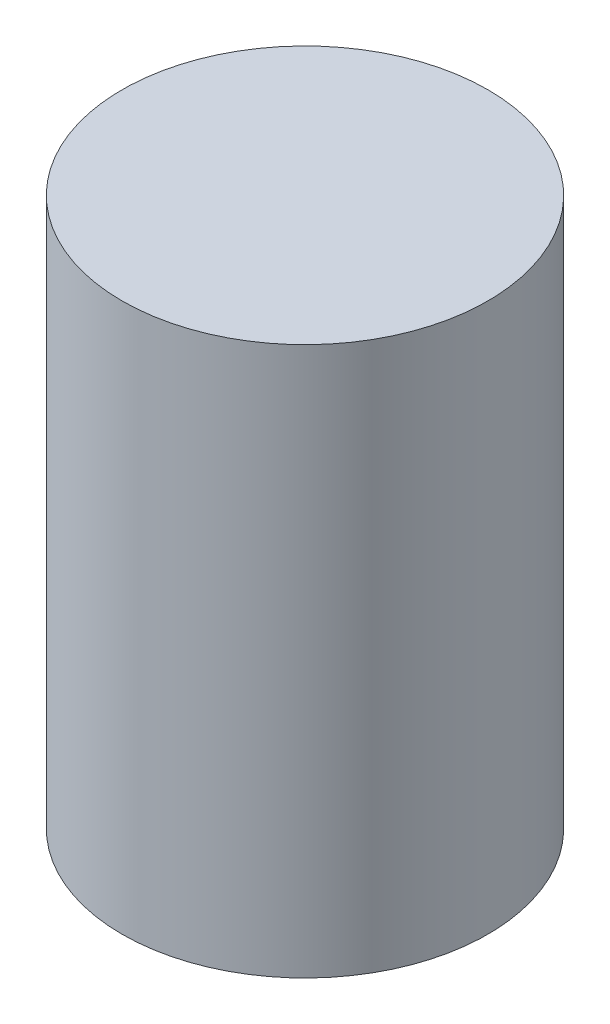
ISO-10303-21;
HEADER;
FILE_DESCRIPTION(('STEP AP214'),'2;1');
FILE_NAME('part.step','',(''),(''),'','','');
FILE_SCHEMA(('AUTOMOTIVE_DESIGN { 1 0 10303 214 1 1 1 1 }'));
ENDSEC;
DATA;
#1=APPLICATION_CONTEXT('core data for automotive mechanical design processes');
#2=APPLICATION_PROTOCOL_DEFINITION('international standard','automotive_design',2000,#1);
#3=PRODUCT_CONTEXT('',#1,'mechanical');
#4=PRODUCT('Part','Part','',(#3));
#5=PRODUCT_RELATED_PRODUCT_CATEGORY('part','',(#4));
#6=PRODUCT_DEFINITION_FORMATION('','',#4);
#7=PRODUCT_DEFINITION_CONTEXT('part definition',#1,'design');
#8=PRODUCT_DEFINITION('design','',#6,#7);
#9=PRODUCT_DEFINITION_SHAPE('','',#8);
#10=(LENGTH_UNIT() NAMED_UNIT(*) SI_UNIT(.MILLI.,.METRE.));
#11=(NAMED_UNIT(*) PLANE_ANGLE_UNIT() SI_UNIT($,.RADIAN.));
#12=(NAMED_UNIT(*) SI_UNIT($,.STERADIAN.) SOLID_ANGLE_UNIT());
#13=UNCERTAINTY_MEASURE_WITH_UNIT(LENGTH_MEASURE(1.E-05),#10,'distance_accuracy_value','');
#14=(GEOMETRIC_REPRESENTATION_CONTEXT(3) GLOBAL_UNCERTAINTY_ASSIGNED_CONTEXT((#13)) GLOBAL_UNIT_ASSIGNED_CONTEXT((#10,
#11,#12)) REPRESENTATION_CONTEXT('',''));
#15=CARTESIAN_POINT('',(0.,0.,0.));
#16=DIRECTION('',(0.,0.,1.));
#17=DIRECTION('',(1.,0.,0.));
#18=AXIS2_PLACEMENT_3D('',#15,#16,#17);
#19=CARTESIAN_POINT('',(0.,152.4,0.));
#20=DIRECTION('',(0.,-1.,0.));
#21=DIRECTION('',(0.,0.,-1.));
#22=AXIS2_PLACEMENT_3D('',#19,#20,#21);
#23=CYLINDRICAL_SURFACE('',#22,50.8240390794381);
#24=CARTESIAN_POINT('',(0.,152.4,0.));
#25=DIRECTION('',(0.,1.,0.));
#26=DIRECTION('',(0.,0.,1.));
#27=AXIS2_PLACEMENT_3D('',#24,#25,#26);
#28=CIRCLE('',#27,50.8240390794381);
#29=CARTESIAN_POINT('',(0.,152.4,-50.8240390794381));
#30=VERTEX_POINT('',#29);
#31=EDGE_CURVE('E10',#30,#30,#28,.T.);
#32=CARTESIAN_POINT('',(0.,0.,0.));
#33=DIRECTION('',(0.,1.,0.));
#34=DIRECTION('',(0.,0.,1.));
#35=AXIS2_PLACEMENT_3D('',#32,#33,#34);
#36=CIRCLE('',#35,50.8240390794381);
#37=CARTESIAN_POINT('',(0.,0.,-50.8240390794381));
#38=VERTEX_POINT('',#37);
#39=EDGE_CURVE('E32',#38,#38,#36,.T.);
#40=CARTESIAN_POINT('',(0.,152.4,-50.8240390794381));
#41=CARTESIAN_POINT('',(0.,150.8125,-50.8240390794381));
#42=CARTESIAN_POINT('',(0.,149.225,-50.8240390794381));
#43=CARTESIAN_POINT('',(0.,146.05,-50.8240390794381));
#44=CARTESIAN_POINT('',(0.,144.4625,-50.8240390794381));
#45=CARTESIAN_POINT('',(0.,141.2875,-50.8240390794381));
#46=CARTESIAN_POINT('',(0.,139.7,-50.8240390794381));
#47=CARTESIAN_POINT('',(0.,136.525,-50.8240390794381));
#48=CARTESIAN_POINT('',(0.,134.9375,-50.8240390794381));
#49=CARTESIAN_POINT('',(0.,131.7625,-50.8240390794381));
#50=CARTESIAN_POINT('',(0.,130.175,-50.8240390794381));
#51=CARTESIAN_POINT('',(0.,127.,-50.8240390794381));
#52=CARTESIAN_POINT('',(0.,125.4125,-50.8240390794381));
#53=CARTESIAN_POINT('',(0.,122.2375,-50.8240390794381));
#54=CARTESIAN_POINT('',(0.,120.65,-50.8240390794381));
#55=CARTESIAN_POINT('',(0.,117.475,-50.8240390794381));
#56=CARTESIAN_POINT('',(0.,115.8875,-50.8240390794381));
#57=CARTESIAN_POINT('',(0.,112.7125,-50.8240390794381));
#58=CARTESIAN_POINT('',(0.,111.125,-50.8240390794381));
#59=CARTESIAN_POINT('',(0.,107.95,-50.8240390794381));
#60=CARTESIAN_POINT('',(0.,106.3625,-50.8240390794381));
#61=CARTESIAN_POINT('',(0.,103.1875,-50.8240390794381));
#62=CARTESIAN_POINT('',(0.,101.6,-50.8240390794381));
#63=CARTESIAN_POINT('',(0.,98.425,-50.8240390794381));
#64=CARTESIAN_POINT('',(0.,96.8375,-50.8240390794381));
#65=CARTESIAN_POINT('',(0.,93.6625,-50.8240390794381));
#66=CARTESIAN_POINT('',(0.,92.075,-50.8240390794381));
#67=CARTESIAN_POINT('',(0.,88.9,-50.8240390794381));
#68=CARTESIAN_POINT('',(0.,87.3125,-50.8240390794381));
#69=CARTESIAN_POINT('',(0.,84.1375,-50.8240390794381));
#70=CARTESIAN_POINT('',(0.,82.55,-50.8240390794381));
#71=CARTESIAN_POINT('',(0.,79.375,-50.8240390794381));
#72=CARTESIAN_POINT('',(0.,77.7875,-50.8240390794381));
#73=CARTESIAN_POINT('',(0.,74.6125,-50.8240390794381));
#74=CARTESIAN_POINT('',(0.,73.025,-50.8240390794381));
#75=CARTESIAN_POINT('',(0.,69.85,-50.8240390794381));
#76=CARTESIAN_POINT('',(0.,68.2625,-50.8240390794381));
#77=CARTESIAN_POINT('',(0.,65.0875,-50.8240390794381));
#78=CARTESIAN_POINT('',(0.,63.5,-50.8240390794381));
#79=CARTESIAN_POINT('',(0.,60.325,-50.8240390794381));
#80=CARTESIAN_POINT('',(0.,58.7375,-50.8240390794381));
#81=CARTESIAN_POINT('',(0.,55.5625,-50.8240390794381));
#82=CARTESIAN_POINT('',(0.,53.975,-50.8240390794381));
#83=CARTESIAN_POINT('',(0.,50.8,-50.8240390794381));
#84=CARTESIAN_POINT('',(0.,49.2125,-50.8240390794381));
#85=CARTESIAN_POINT('',(0.,46.0375,-50.8240390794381));
#86=CARTESIAN_POINT('',(0.,44.45,-50.8240390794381));
#87=CARTESIAN_POINT('',(0.,41.275,-50.8240390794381));
#88=CARTESIAN_POINT('',(0.,39.6875,-50.8240390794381));
#89=CARTESIAN_POINT('',(0.,36.5125,-50.8240390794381));
#90=CARTESIAN_POINT('',(0.,34.925,-50.8240390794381));
#91=CARTESIAN_POINT('',(0.,31.75,-50.8240390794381));
#92=CARTESIAN_POINT('',(0.,30.1625,-50.8240390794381));
#93=CARTESIAN_POINT('',(0.,26.9875,-50.8240390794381));
#94=CARTESIAN_POINT('',(0.,25.4,-50.8240390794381));
#95=CARTESIAN_POINT('',(0.,22.225,-50.8240390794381));
#96=CARTESIAN_POINT('',(0.,20.6375,-50.8240390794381));
#97=CARTESIAN_POINT('',(0.,17.4625,-50.8240390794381));
#98=CARTESIAN_POINT('',(0.,15.875,-50.8240390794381));
#99=CARTESIAN_POINT('',(0.,12.7,-50.8240390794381));
#100=CARTESIAN_POINT('',(0.,11.1125,-50.8240390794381));
#101=CARTESIAN_POINT('',(0.,7.93750000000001,-50.8240390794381));
#102=CARTESIAN_POINT('',(0.,6.35,-50.8240390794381));
#103=CARTESIAN_POINT('',(0.,3.175,-50.8240390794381));
#104=CARTESIAN_POINT('',(0.,1.5875,-50.8240390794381));
#105=CARTESIAN_POINT('',(0.,0.,-50.8240390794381));
#106=B_SPLINE_CURVE_WITH_KNOTS('',3,(#40,#41,#42,#43,#44,#45,#46,#47,#48,#49,#50,#51,#52,#53,
#54,#55,#56,#57,#58,#59,#60,#61,#62,#63,#64,#65,#66,#67,#68,#69,#70,#71,#72,#73,#74,#75,#76,#77,
#78,#79,#80,#81,#82,#83,#84,#85,#86,#87,#88,#89,#90,#91,#92,#93,#94,#95,#96,#97,#98,#99,#100,
#101,#102,#103,#104,#105),.UNSPECIFIED.,.F.,.F.,(4,2,2,2,2,2,2,2,2,2,2,2,2,2,2,2,2,2,2,2,2,2,2,
2,2,2,2,2,2,2,2,2,4),(0.,4.76249999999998,9.52499999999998,14.2875,19.05,23.8125,28.575,33.3375,
38.1,42.8625,47.625,52.3875,57.15,61.9125,66.675,71.4375,76.2,80.9625,85.725,90.4875,95.25,
100.0125,104.775,109.5375,114.3,119.0625,123.825,128.5875,133.35,138.1125,142.875,147.6375,
152.4),.UNSPECIFIED.);
#107=EDGE_CURVE('BSEAM29',#30,#38,#106,.T.);
#108=ORIENTED_EDGE('',*,*,#31,.F.);
#109=ORIENTED_EDGE('',*,*,#39,.T.);
#110=ORIENTED_EDGE('',*,*,#107,.T.);
#111=ORIENTED_EDGE('',*,*,#107,.F.);
#112=EDGE_LOOP('',(#108,#110,#109,#111));
#113=FACE_BOUND('',#112,.T.);
#114=ADVANCED_FACE('F29',(#113),#23,.T.);
#115=CARTESIAN_POINT('',(0.,152.4,0.));
#116=DIRECTION('',(0.,1.,0.));
#117=DIRECTION('',(0.,0.,1.));
#118=AXIS2_PLACEMENT_3D('',#115,#116,#117);
#119=PLANE('',#118);
#120=ORIENTED_EDGE('',*,*,#31,.T.);
#121=EDGE_LOOP('',(#120));
#122=FACE_BOUND('',#121,.T.);
#123=ADVANCED_FACE('F44',(#122),#119,.T.);
#124=CARTESIAN_POINT('',(0.,0.,0.));
#125=DIRECTION('',(0.,1.,0.));
#126=DIRECTION('',(0.,0.,1.));
#127=AXIS2_PLACEMENT_3D('',#124,#125,#126);
#128=PLANE('',#127);
#129=ORIENTED_EDGE('',*,*,#39,.F.);
#130=EDGE_LOOP('',(#129));
#131=FACE_BOUND('',#130,.T.);
#132=ADVANCED_FACE('F42',(#131),#128,.F.);
#133=CLOSED_SHELL('',(#114,#123,#132));
#134=MANIFOLD_SOLID_BREP('B2',#133);
#135=ADVANCED_BREP_SHAPE_REPRESENTATION('',(#18,#134),#14);
#136=SHAPE_DEFINITION_REPRESENTATION(#9,#135);
ENDSEC;
END-ISO-10303-21;
